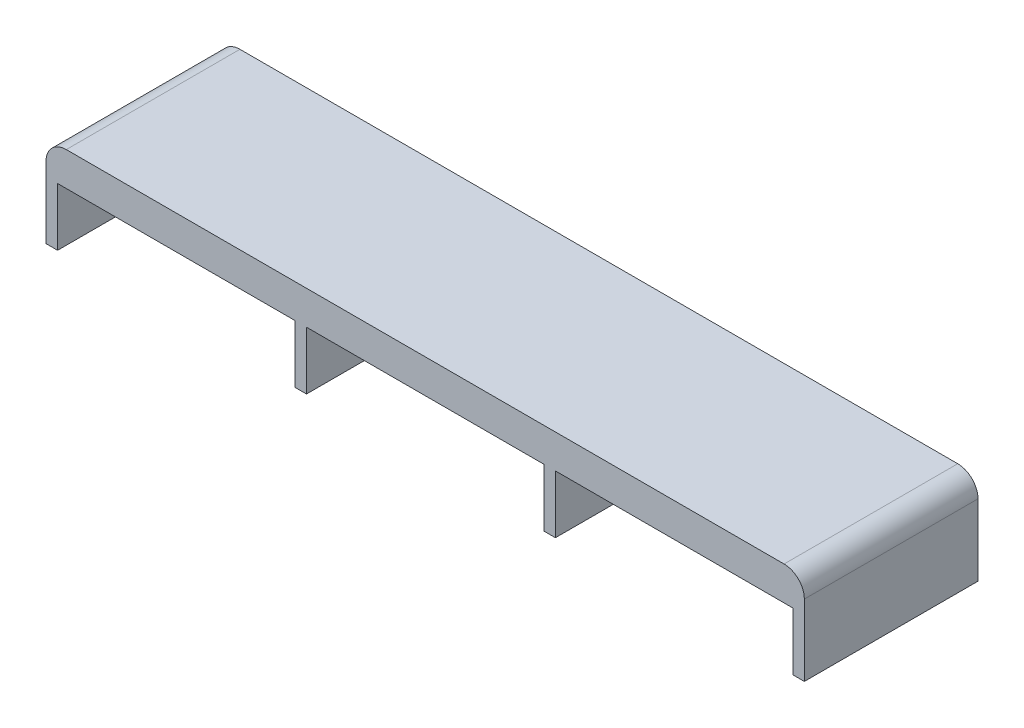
from build123d import *

# Parameters (mm, degrees)
EXTRUDE1_DEPTH = 150
FILLET1_R      = 35


with BuildPart() as part:
    # Sketch1 → Extrude1 (new, symmetric)
    with BuildSketch(Plane.XY):
        Polygon((-655, 58.243881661), (-655, -100), (-635, -100), (-635, 0), (-225, 0), (-225, -100), (-205, -100), (-205, 0), (205, 0), (205, -100), (225, -100), (225, 0), (635, 0), (635, -100), (655, -100), (655, 58.243881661), align=None)
    extrude(amount=EXTRUDE1_DEPTH, both=True)

    # Fillet1
    fillet1_edges = [part.edges().sort_by_distance(p)[0] for p in [
        (-655, 58.243881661, 0),
        (655, 58.243881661, 0),
    ]]
    fillet(fillet1_edges, radius=FILLET1_R)


solid = part.part
